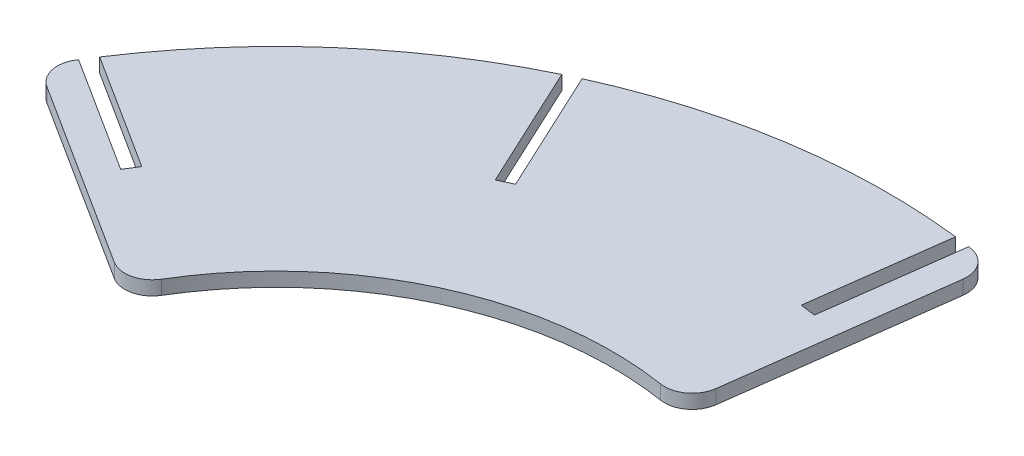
from build123d import *

# Parameters (mm, degrees)
SALIENTE_EXTRUIR1_DEPTH = 23
REDONDEO1_R             = 45
REDONDEO2_R             = 45
REDONDEO3_R             = 45


with BuildPart() as part:
    # Croquis3 → Saliente-Extruir1 (new body)
    with BuildSketch(Plane(origin=(0, 0, 0), x_dir=(1, 0, 0), z_dir=(0, 1, 0))):
        with BuildLine():
            Line((90.789454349, 342.612736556), (66.003332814, 345.875891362))
            Line((66.003332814, 345.875891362), (95.372665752, 568.958122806))
            ThreePointArc((95.372665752, 568.958122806), (-174.873654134, 564.320654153), (-434.006664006, 487.478850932))
            Line((-434.006664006, 487.478850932), (-338.91451259, 283.553074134))
            Line((-338.91451259, 283.553074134), (-361.572207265, 272.987617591))
            Line((-361.572207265, 272.987617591), (-456.664358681, 476.913394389))
            ThreePointArc((-456.664358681, 476.913394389), (-682.096083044, 327.798951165), (-859.359576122, 123.759166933))
            Line((-859.359576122, 123.759166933), (-669.590429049, 2.862886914))
            Line((-669.590429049, 2.862886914), (-683.022919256, -18.22189923))
            Line((-683.022919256, -18.22189923), (-872.792066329, 102.67438079))
            ThreePointArc((-872.792066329, 102.67438079), (-885.069697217, 82.323836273), (-896.860216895, 61.687253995))
            Line((-896.860216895, 61.687253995), (-516.085088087, -180.893256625))
            ThreePointArc((-516.085088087, -180.893256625), (-255.1903119, 74.428426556), (108.097374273, 110.167805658))
            Line((108.097374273, 110.167805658), (167.027456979, 557.786223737))
            ThreePointArc((167.027456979, 557.786223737), (143.640117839, 562.019101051), (120.158787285, 565.694968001))
            Line((120.158787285, 565.694968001), (90.789454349, 342.612736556))
        make_face()
    extrude(amount=SALIENTE_EXTRUIR1_DEPTH)

    # Redondeo1
    redondeo1_edges = [part.edges().sort_by_distance(p)[0] for p in [
        (167.027456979, 11.5, -557.786223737),
    ]]
    fillet(redondeo1_edges, radius=REDONDEO1_R)

    # Redondeo2
    redondeo2_edges = [part.edges().sort_by_distance(p)[0] for p in [
        (108.097374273, 11.5, -110.167805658),
    ]]
    fillet(redondeo2_edges, radius=REDONDEO2_R)

    # Redondeo3
    redondeo3_edges = [part.edges().sort_by_distance(p)[0] for p in [
        (-516.085088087, 11.5, 180.893256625),
        (-896.860216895, 11.5, -61.687253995),
    ]]
    fillet(redondeo3_edges, radius=REDONDEO3_R)


solid = part.part
